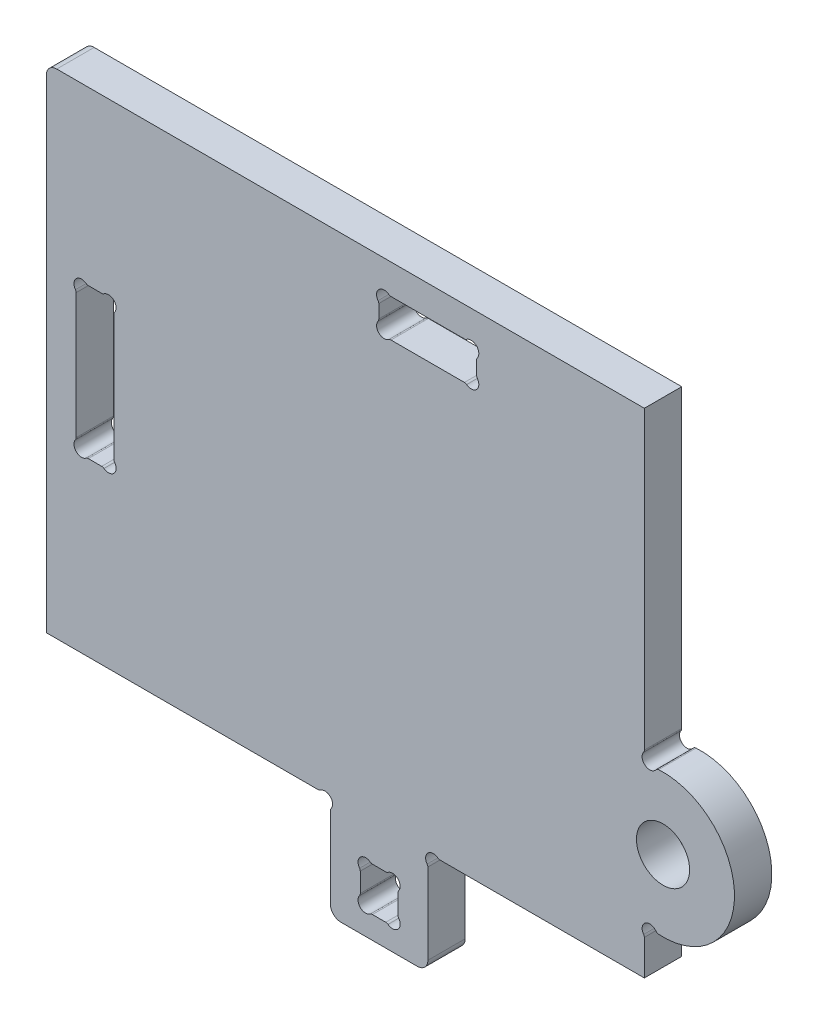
from build123d import *

# Parameters (mm, degrees)
ESQUISSE2_R        = 17.77766953
BOSS_EXTRU_2_DEPTH = 25
CONG_1_R           = 7
CUT_EXTRUDE2_DEPTH = 483.710105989


with BuildPart() as part:
    # Esquisse2 → Boss.-Extru.2 (new body)
    with BuildSketch(Plane.XY):
        with BuildLine():
            Line((0, 0), (65.2, 0))
            Line((65.2, 0), (65.2, 61.035626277))
            ThreePointArc((65.2, 61.035626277), (65.073982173, 61.81934092), (64.708633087, 62.52404595))
            ThreePointArc((64.708633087, 62.52404595), (65.2, 69.166666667), (71.842620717, 69.65803358))
            ThreePointArc((71.842620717, 69.65803358), (72.547325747, 69.292684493), (73.331040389, 69.166666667))
            Line((73.331040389, 69.166666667), (210, 69.166666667))
            Line((210, 69.166666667), (210, 92.699786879))
            ThreePointArc((210, 92.699786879), (209.873982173, 93.483501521), (209.508633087, 94.188206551))
            ThreePointArc((209.508633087, 94.188206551), (210.568751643, 101.321366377), (217.702200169, 100.263192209))
            ThreePointArc((217.702200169, 100.263192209), (218.517840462, 99.555275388), (219.555973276, 99.257457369))
            ThreePointArc((219.555973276, 99.257457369), (270.27766953, 146.944336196), (219.555973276, 194.631215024))
            ThreePointArc((219.555973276, 194.631215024), (218.517840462, 194.333397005), (217.702200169, 193.625480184))
            ThreePointArc((217.702200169, 193.625480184), (210.568751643, 192.567306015), (209.508633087, 199.700465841))
            ThreePointArc((209.508633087, 199.700465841), (209.873982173, 200.405170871), (210, 201.188885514))
            Line((210, 201.188885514), (210, 399.166666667))
            Line((210, 399.166666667), (-190, 399.166666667))
            Line((-190, 399.166666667), (-190, 69.166666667))
            Line((-190, 69.166666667), (-8.131040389, 69.166666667))
            ThreePointArc((-8.131040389, 69.166666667), (-7.347325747, 69.292684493), (-6.642620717, 69.65803358))
            ThreePointArc((-6.642620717, 69.65803358), (0, 69.166666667), (0.491366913, 62.52404595))
            ThreePointArc((0.491366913, 62.52404595), (0.126017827, 61.81934092), (0, 61.035626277))
            Line((0, 61.035626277), (0, 0))
        make_face()
        with Locations((222.5, 146.944336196)):
            Circle(ESQUISSE2_R, mode=Mode.SUBTRACT)
        with BuildLine():
            Line((20, 23.131040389), (20, 36.035626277))
            ThreePointArc((20, 36.035626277), (19.873982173, 36.81934092), (19.508633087, 37.52404595))
            ThreePointArc((19.508633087, 37.52404595), (20, 44.166666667), (26.642620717, 44.65803358))
            ThreePointArc((26.642620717, 44.65803358), (27.347325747, 44.292684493), (28.131040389, 44.166666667))
            Line((28.131040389, 44.166666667), (37.068959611, 44.166666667))
            ThreePointArc((37.068959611, 44.166666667), (37.852674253, 44.292684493), (38.557379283, 44.65803358))
            ThreePointArc((38.557379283, 44.65803358), (45.2, 44.166666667), (45.691366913, 37.52404595))
            ThreePointArc((45.691366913, 37.52404595), (45.326017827, 36.81934092), (45.2, 36.035626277))
            Line((45.2, 36.035626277), (45.2, 23.131040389))
            ThreePointArc((45.2, 23.131040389), (45.326017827, 22.347325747), (45.691366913, 21.642620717))
            ThreePointArc((45.691366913, 21.642620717), (45.2, 15), (38.557379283, 14.508633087))
            ThreePointArc((38.557379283, 14.508633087), (37.852674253, 14.873982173), (37.068959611, 15))
            Line((37.068959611, 15), (28.131040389, 15))
            ThreePointArc((28.131040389, 15), (27.347325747, 14.873982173), (26.642620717, 14.508633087))
            ThreePointArc((26.642620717, 14.508633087), (20, 15), (19.508633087, 21.642620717))
            ThreePointArc((19.508633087, 21.642620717), (19.873982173, 22.347325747), (20, 23.131040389))
        make_face(mode=Mode.SUBTRACT)
    extrude(amount=BOSS_EXTRU_2_DEPTH)

    # Cong_1
    cong_1_edges = [part.edges().sort_by_distance(p)[0] for p in [
        (-190, 399.166666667, 12.5),
        (65.2, 0, 12.5),
        (0, 0, 12.5),
    ]]
    fillet(cong_1_edges, radius=CONG_1_R)

    # Sketch4 → Cut-Extrude2 (cut, through all)
    with BuildSketch(Plane.XY.offset(25)):
        with BuildLine():
            Line((-144.8, 276.135626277), (-144.8, 192.197707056))
            ThreePointArc((-144.8, 192.197707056), (-144.673982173, 191.413992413), (-144.308633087, 190.709287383))
            ThreePointArc((-144.308633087, 190.709287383), (-144.8, 184.066666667), (-151.442620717, 183.575299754))
            ThreePointArc((-151.442620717, 183.575299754), (-152.147325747, 183.94064884), (-152.931040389, 184.066666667))
            Line((-152.931040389, 184.066666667), (-161.868959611, 184.066666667))
            ThreePointArc((-161.868959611, 184.066666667), (-162.652674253, 183.94064884), (-163.357379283, 183.575299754))
            ThreePointArc((-163.357379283, 183.575299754), (-170, 184.066666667), (-170.491366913, 190.709287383))
            ThreePointArc((-170.491366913, 190.709287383), (-170.126017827, 191.413992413), (-170, 192.197707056))
            Line((-170, 192.197707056), (-170, 276.135626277))
            ThreePointArc((-170, 276.135626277), (-170.126017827, 276.91934092), (-170.491366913, 277.62404595))
            ThreePointArc((-170.491366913, 277.62404595), (-170, 284.266666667), (-163.357379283, 284.75803358))
            ThreePointArc((-163.357379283, 284.75803358), (-162.652674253, 284.392684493), (-161.868959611, 284.266666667))
            Line((-161.868959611, 284.266666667), (-152.931040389, 284.266666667))
            ThreePointArc((-152.931040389, 284.266666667), (-152.147325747, 284.392684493), (-151.442620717, 284.75803358))
            ThreePointArc((-151.442620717, 284.75803358), (-144.8, 284.266666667), (-144.308633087, 277.62404595))
            ThreePointArc((-144.308633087, 277.62404595), (-144.673982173, 276.91934092), (-144.8, 276.135626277))
        make_face()
        with BuildLine():
            Line((89.668959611, 353.966666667), (40.531040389, 353.966666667))
            ThreePointArc((40.531040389, 353.966666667), (39.747325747, 353.84064884), (39.042620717, 353.475299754))
            ThreePointArc((39.042620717, 353.475299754), (32.4, 353.966666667), (31.908633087, 360.609287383))
            ThreePointArc((31.908633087, 360.609287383), (32.273982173, 361.313992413), (32.4, 362.097707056))
            Line((32.4, 362.097707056), (32.4, 371.035626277))
            ThreePointArc((32.4, 371.035626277), (32.273982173, 371.81934092), (31.908633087, 372.52404595))
            ThreePointArc((31.908633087, 372.52404595), (32.4, 379.166666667), (39.042620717, 379.65803358))
            ThreePointArc((39.042620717, 379.65803358), (39.747325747, 379.292684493), (40.531040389, 379.166666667))
            Line((40.531040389, 379.166666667), (89.668959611, 379.166666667))
            ThreePointArc((89.668959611, 379.166666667), (90.452674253, 379.292684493), (91.157379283, 379.65803358))
            ThreePointArc((91.157379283, 379.65803358), (97.8, 379.166666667), (98.291366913, 372.52404595))
            ThreePointArc((98.291366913, 372.52404595), (97.926017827, 371.81934092), (97.8, 371.035626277))
            Line((97.8, 371.035626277), (97.8, 362.097707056))
            ThreePointArc((97.8, 362.097707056), (97.926017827, 361.313992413), (98.291366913, 360.609287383))
            ThreePointArc((98.291366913, 360.609287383), (97.8, 353.966666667), (91.157379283, 353.475299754))
            ThreePointArc((91.157379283, 353.475299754), (90.452674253, 353.84064884), (89.668959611, 353.966666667))
        make_face()
    extrude(amount=-CUT_EXTRUDE2_DEPTH, mode=Mode.SUBTRACT)


solid = part.part
